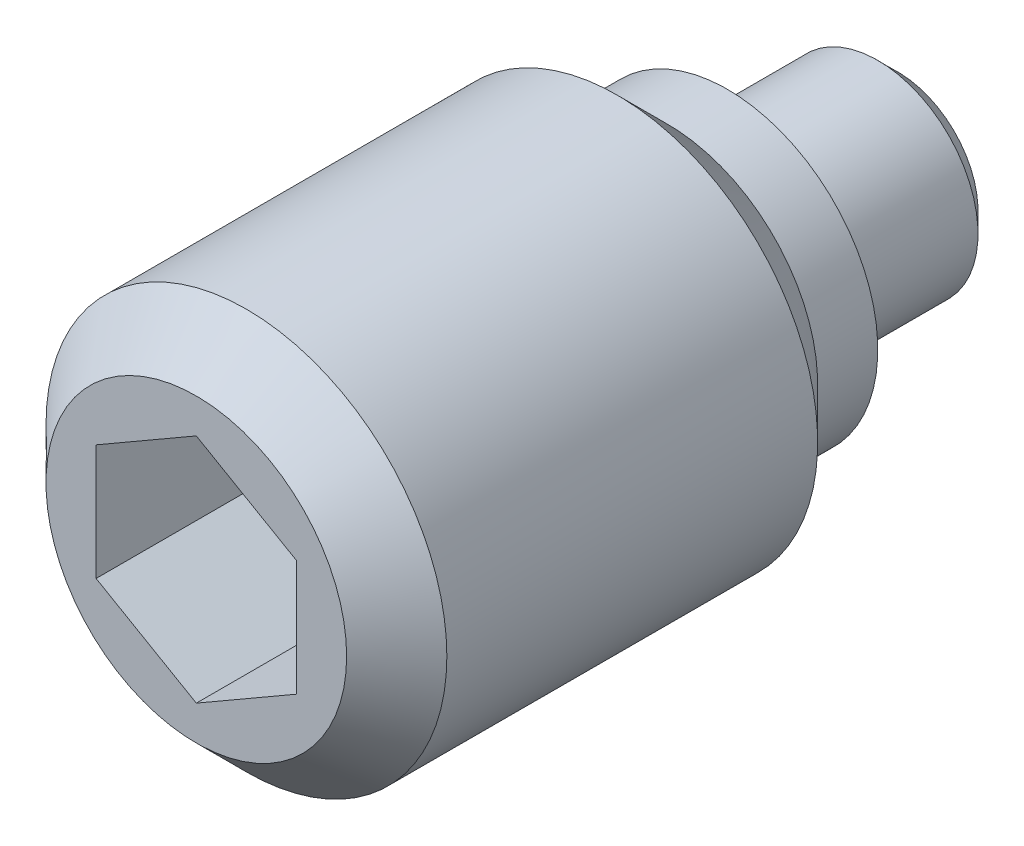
ISO-10303-21;
HEADER;
FILE_DESCRIPTION(('STEP AP214'),'2;1');
FILE_NAME('part.step','',(''),(''),'','','');
FILE_SCHEMA(('AUTOMOTIVE_DESIGN { 1 0 10303 214 1 1 1 1 }'));
ENDSEC;
DATA;
#1=APPLICATION_CONTEXT('core data for automotive mechanical design processes');
#2=APPLICATION_PROTOCOL_DEFINITION('international standard','automotive_design',2000,#1);
#3=PRODUCT_CONTEXT('',#1,'mechanical');
#4=PRODUCT('Part','Part','',(#3));
#5=PRODUCT_RELATED_PRODUCT_CATEGORY('part','',(#4));
#6=PRODUCT_DEFINITION_FORMATION('','',#4);
#7=PRODUCT_DEFINITION_CONTEXT('part definition',#1,'design');
#8=PRODUCT_DEFINITION('design','',#6,#7);
#9=PRODUCT_DEFINITION_SHAPE('','',#8);
#10=(LENGTH_UNIT() NAMED_UNIT(*) SI_UNIT(.MILLI.,.METRE.));
#11=(NAMED_UNIT(*) PLANE_ANGLE_UNIT() SI_UNIT($,.RADIAN.));
#12=(NAMED_UNIT(*) SI_UNIT($,.STERADIAN.) SOLID_ANGLE_UNIT());
#13=UNCERTAINTY_MEASURE_WITH_UNIT(LENGTH_MEASURE(1.E-05),#10,'distance_accuracy_value','');
#14=(GEOMETRIC_REPRESENTATION_CONTEXT(3) GLOBAL_UNCERTAINTY_ASSIGNED_CONTEXT((#13)) GLOBAL_UNIT_ASSIGNED_CONTEXT((#10,
#11,#12)) REPRESENTATION_CONTEXT('',''));
#15=CARTESIAN_POINT('',(0.,0.,0.));
#16=DIRECTION('',(0.,0.,1.));
#17=DIRECTION('',(1.,0.,0.));
#18=AXIS2_PLACEMENT_3D('',#15,#16,#17);
#19=CARTESIAN_POINT('',(0.,0.,0.));
#20=DIRECTION('',(0.,0.,-1.));
#21=DIRECTION('',(-1.,0.,0.));
#22=AXIS2_PLACEMENT_3D('',#19,#20,#21);
#23=CYLINDRICAL_SURFACE('',#22,1.);
#24=CARTESIAN_POINT('',(0.,0.,0.2));
#25=DIRECTION('',(0.,0.,-1.));
#26=DIRECTION('',(-1.,0.,0.));
#27=AXIS2_PLACEMENT_3D('',#24,#25,#26);
#28=CIRCLE('',#27,1.);
#29=CARTESIAN_POINT('',(-1.,0.,0.2));
#30=VERTEX_POINT('',#29);
#31=EDGE_CURVE('E133',#30,#30,#28,.T.);
#32=ORIENTED_EDGE('',*,*,#31,.F.);
#33=EDGE_LOOP('',(#32));
#34=FACE_BOUND('',#33,.T.);
#35=CARTESIAN_POINT('',(0.,0.,1.7));
#36=DIRECTION('',(0.,0.,-1.));
#37=DIRECTION('',(-1.,0.,0.));
#38=AXIS2_PLACEMENT_3D('',#35,#36,#37);
#39=CIRCLE('',#38,1.);
#40=CARTESIAN_POINT('',(-1.,0.,1.7));
#41=VERTEX_POINT('',#40);
#42=EDGE_CURVE('E127',#41,#41,#39,.T.);
#43=ORIENTED_EDGE('',*,*,#42,.T.);
#44=EDGE_LOOP('',(#43));
#45=FACE_BOUND('',#44,.T.);
#46=ADVANCED_FACE('F14',(#34,#45),#23,.T.);
#47=CARTESIAN_POINT('',(0.,0.,0.2));
#48=DIRECTION('',(0.,0.,1.));
#49=DIRECTION('',(1.,0.,0.));
#50=AXIS2_PLACEMENT_3D('',#47,#48,#49);
#51=CONICAL_SURFACE('',#50,1.,0.785398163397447);
#52=CARTESIAN_POINT('',(0.,0.,0.));
#53=DIRECTION('',(0.,0.,-1.));
#54=DIRECTION('',(-1.,0.,0.));
#55=AXIS2_PLACEMENT_3D('',#52,#53,#54);
#56=CIRCLE('',#55,0.8);
#57=CARTESIAN_POINT('',(-0.8,0.,0.));
#58=VERTEX_POINT('',#57);
#59=EDGE_CURVE('E130',#58,#58,#56,.T.);
#60=ORIENTED_EDGE('',*,*,#59,.F.);
#61=EDGE_LOOP('',(#60));
#62=FACE_BOUND('',#61,.T.);
#63=ORIENTED_EDGE('',*,*,#31,.T.);
#64=EDGE_LOOP('',(#63));
#65=FACE_BOUND('',#64,.T.);
#66=ADVANCED_FACE('F157',(#62,#65),#51,.T.);
#67=CARTESIAN_POINT('',(0.,0.8,0.));
#68=DIRECTION('',(0.,0.,1.));
#69=DIRECTION('',(1.,0.,0.));
#70=AXIS2_PLACEMENT_3D('',#67,#68,#69);
#71=PLANE('',#70);
#72=ORIENTED_EDGE('',*,*,#59,.T.);
#73=EDGE_LOOP('',(#72));
#74=FACE_BOUND('',#73,.T.);
#75=ADVANCED_FACE('F154',(#74),#71,.F.);
#76=CARTESIAN_POINT('',(0.,0.,1.7));
#77=DIRECTION('',(0.,0.,-1.));
#78=DIRECTION('',(-1.,0.,0.));
#79=AXIS2_PLACEMENT_3D('',#76,#77,#78);
#80=CYLINDRICAL_SURFACE('',#79,2.);
#81=CARTESIAN_POINT('',(0.,0.,2.8));
#82=DIRECTION('',(0.,0.,-1.));
#83=DIRECTION('',(-1.,0.,0.));
#84=AXIS2_PLACEMENT_3D('',#81,#82,#83);
#85=CIRCLE('',#84,2.);
#86=CARTESIAN_POINT('',(-2.,0.,2.8));
#87=VERTEX_POINT('',#86);
#88=EDGE_CURVE('E9',#87,#87,#85,.T.);
#89=ORIENTED_EDGE('',*,*,#88,.F.);
#90=EDGE_LOOP('',(#89));
#91=FACE_BOUND('',#90,.T.);
#92=CARTESIAN_POINT('',(0.,0.,6.5));
#93=DIRECTION('',(0.,0.,1.));
#94=DIRECTION('',(1.,0.,0.));
#95=AXIS2_PLACEMENT_3D('',#92,#93,#94);
#96=CIRCLE('',#95,2.);
#97=CARTESIAN_POINT('',(2.,0.,6.5));
#98=VERTEX_POINT('',#97);
#99=EDGE_CURVE('E124',#98,#98,#96,.T.);
#100=ORIENTED_EDGE('',*,*,#99,.F.);
#101=EDGE_LOOP('',(#100));
#102=FACE_BOUND('',#101,.T.);
#103=ADVANCED_FACE('F16',(#91,#102),#80,.T.);
#104=CARTESIAN_POINT('',(0.,0.,2.8));
#105=DIRECTION('',(0.,0.,1.));
#106=DIRECTION('',(1.,0.,0.));
#107=AXIS2_PLACEMENT_3D('',#104,#105,#106);
#108=CONICAL_SURFACE('',#107,2.,0.785398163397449);
#109=ORIENTED_EDGE('',*,*,#88,.T.);
#110=EDGE_LOOP('',(#109));
#111=FACE_BOUND('',#110,.T.);
#112=CARTESIAN_POINT('',(0.,0.,2.3));
#113=DIRECTION('',(0.,0.,-1.));
#114=DIRECTION('',(-1.,0.,0.));
#115=AXIS2_PLACEMENT_3D('',#112,#113,#114);
#116=CIRCLE('',#115,1.5);
#117=CARTESIAN_POINT('',(-1.5,0.,2.3));
#118=VERTEX_POINT('',#117);
#119=EDGE_CURVE('E22',#118,#118,#116,.T.);
#120=ORIENTED_EDGE('',*,*,#119,.F.);
#121=EDGE_LOOP('',(#120));
#122=FACE_BOUND('',#121,.T.);
#123=ADVANCED_FACE('F143',(#111,#122),#108,.T.);
#124=CARTESIAN_POINT('',(0.,0.,1.7));
#125=DIRECTION('',(0.,0.,-1.));
#126=DIRECTION('',(-1.,0.,0.));
#127=AXIS2_PLACEMENT_3D('',#124,#125,#126);
#128=CYLINDRICAL_SURFACE('',#127,1.5);
#129=CARTESIAN_POINT('',(0.,0.,1.7));
#130=DIRECTION('',(0.,0.,-1.));
#131=DIRECTION('',(-1.,0.,0.));
#132=AXIS2_PLACEMENT_3D('',#129,#130,#131);
#133=CIRCLE('',#132,1.5);
#134=CARTESIAN_POINT('',(-1.5,0.,1.7));
#135=VERTEX_POINT('',#134);
#136=EDGE_CURVE('E136',#135,#135,#133,.T.);
#137=ORIENTED_EDGE('',*,*,#136,.F.);
#138=EDGE_LOOP('',(#137));
#139=FACE_BOUND('',#138,.T.);
#140=ORIENTED_EDGE('',*,*,#119,.T.);
#141=EDGE_LOOP('',(#140));
#142=FACE_BOUND('',#141,.T.);
#143=ADVANCED_FACE('F141',(#139,#142),#128,.T.);
#144=CARTESIAN_POINT('',(0.,1.5,1.7));
#145=DIRECTION('',(0.,0.,1.));
#146=DIRECTION('',(1.,0.,0.));
#147=AXIS2_PLACEMENT_3D('',#144,#145,#146);
#148=PLANE('',#147);
#149=ORIENTED_EDGE('',*,*,#136,.T.);
#150=EDGE_LOOP('',(#149));
#151=FACE_BOUND('',#150,.T.);
#152=ORIENTED_EDGE('',*,*,#42,.F.);
#153=EDGE_LOOP('',(#152));
#154=FACE_BOUND('',#153,.T.);
#155=ADVANCED_FACE('F151',(#151,#154),#148,.F.);
#156=CARTESIAN_POINT('',(0.,-1.5,7.));
#157=DIRECTION('',(0.,0.,1.));
#158=DIRECTION('',(1.,0.,0.));
#159=AXIS2_PLACEMENT_3D('',#156,#157,#158);
#160=PLANE('',#159);
#161=DIRECTION('',(0.866025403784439,-0.5,0.));
#162=VECTOR('',#161,1.);
#163=CARTESIAN_POINT('',(-1.,-0.577350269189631,7.));
#164=LINE('',#163,#162);
#165=CARTESIAN_POINT('',(-1.,-0.577350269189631,7.));
#166=VERTEX_POINT('',#165);
#167=CARTESIAN_POINT('',(0.,-1.15470053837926,7.));
#168=VERTEX_POINT('',#167);
#169=EDGE_CURVE('E29',#166,#168,#164,.T.);
#170=ORIENTED_EDGE('',*,*,#169,.F.);
#171=DIRECTION('',(0.,-1.,0.));
#172=VECTOR('',#171,1.);
#173=CARTESIAN_POINT('',(-1.,0.577350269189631,7.));
#174=LINE('',#173,#172);
#175=CARTESIAN_POINT('',(-1.,0.577350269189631,7.));
#176=VERTEX_POINT('',#175);
#177=EDGE_CURVE('E112',#176,#166,#174,.T.);
#178=ORIENTED_EDGE('',*,*,#177,.F.);
#179=DIRECTION('',(-0.866025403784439,-0.5,0.));
#180=VECTOR('',#179,1.);
#181=CARTESIAN_POINT('',(0.,1.15470053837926,7.));
#182=LINE('',#181,#180);
#183=CARTESIAN_POINT('',(0.,1.15470053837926,7.));
#184=VERTEX_POINT('',#183);
#185=EDGE_CURVE('E110',#184,#176,#182,.T.);
#186=ORIENTED_EDGE('',*,*,#185,.F.);
#187=DIRECTION('',(-0.866025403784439,0.5,0.));
#188=VECTOR('',#187,1.);
#189=CARTESIAN_POINT('',(1.,0.577350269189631,7.));
#190=LINE('',#189,#188);
#191=CARTESIAN_POINT('',(1.,0.577350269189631,7.));
#192=VERTEX_POINT('',#191);
#193=EDGE_CURVE('E77',#192,#184,#190,.T.);
#194=ORIENTED_EDGE('',*,*,#193,.F.);
#195=DIRECTION('',(0.,1.,0.));
#196=VECTOR('',#195,1.);
#197=CARTESIAN_POINT('',(1.,-0.577350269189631,7.));
#198=LINE('',#197,#196);
#199=CARTESIAN_POINT('',(1.,-0.577350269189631,7.));
#200=VERTEX_POINT('',#199);
#201=EDGE_CURVE('E106',#200,#192,#198,.T.);
#202=ORIENTED_EDGE('',*,*,#201,.F.);
#203=DIRECTION('',(0.866025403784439,0.5,0.));
#204=VECTOR('',#203,1.);
#205=CARTESIAN_POINT('',(0.,-1.15470053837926,7.));
#206=LINE('',#205,#204);
#207=EDGE_CURVE('E103',#168,#200,#206,.T.);
#208=ORIENTED_EDGE('',*,*,#207,.F.);
#209=EDGE_LOOP('',(#170,#178,#186,#194,#202,#208));
#210=FACE_BOUND('',#209,.T.);
#211=CARTESIAN_POINT('',(0.,0.,7.));
#212=DIRECTION('',(0.,0.,1.));
#213=DIRECTION('',(1.,0.,0.));
#214=AXIS2_PLACEMENT_3D('',#211,#212,#213);
#215=CIRCLE('',#214,1.5);
#216=CARTESIAN_POINT('',(1.5,0.,7.));
#217=VERTEX_POINT('',#216);
#218=EDGE_CURVE('E116',#217,#217,#215,.T.);
#219=ORIENTED_EDGE('',*,*,#218,.T.);
#220=EDGE_LOOP('',(#219));
#221=FACE_BOUND('',#220,.T.);
#222=ADVANCED_FACE('F170',(#210,#221),#160,.T.);
#223=CARTESIAN_POINT('',(0.,0.,7.));
#224=DIRECTION('',(0.,0.,-1.));
#225=DIRECTION('',(-1.,0.,0.));
#226=AXIS2_PLACEMENT_3D('',#223,#224,#225);
#227=CONICAL_SURFACE('',#226,1.5,0.785398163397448);
#228=ORIENTED_EDGE('',*,*,#99,.T.);
#229=EDGE_LOOP('',(#228));
#230=FACE_BOUND('',#229,.T.);
#231=ORIENTED_EDGE('',*,*,#218,.F.);
#232=EDGE_LOOP('',(#231));
#233=FACE_BOUND('',#232,.T.);
#234=ADVANCED_FACE('F175',(#230,#233),#227,.T.);
#235=CARTESIAN_POINT('',(-1.,-0.577350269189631,5.));
#236=DIRECTION('',(-0.5,-0.866025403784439,0.));
#237=DIRECTION('',(0.866025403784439,-0.5,0.));
#238=AXIS2_PLACEMENT_3D('',#235,#236,#237);
#239=PLANE('',#238);
#240=ORIENTED_EDGE('',*,*,#169,.T.);
#241=DIRECTION('',(0.,0.,1.));
#242=VECTOR('',#241,1.);
#243=CARTESIAN_POINT('',(0.,-1.15470053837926,5.));
#244=LINE('',#243,#242);
#245=CARTESIAN_POINT('',(0.,-1.15470053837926,5.));
#246=VERTEX_POINT('',#245);
#247=EDGE_CURVE('E59',#246,#168,#244,.T.);
#248=ORIENTED_EDGE('',*,*,#247,.F.);
#249=DIRECTION('',(0.866025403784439,-0.5,0.));
#250=VECTOR('',#249,1.);
#251=CARTESIAN_POINT('',(-1.,-0.577350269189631,5.));
#252=LINE('',#251,#250);
#253=CARTESIAN_POINT('',(-1.,-0.577350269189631,5.));
#254=VERTEX_POINT('',#253);
#255=EDGE_CURVE('E114',#254,#246,#252,.T.);
#256=ORIENTED_EDGE('',*,*,#255,.F.);
#257=DIRECTION('',(0.,0.,1.));
#258=VECTOR('',#257,1.);
#259=CARTESIAN_POINT('',(-1.,-0.577350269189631,5.));
#260=LINE('',#259,#258);
#261=EDGE_CURVE('E37',#254,#166,#260,.T.);
#262=ORIENTED_EDGE('',*,*,#261,.T.);
#263=EDGE_LOOP('',(#240,#248,#256,#262));
#264=FACE_BOUND('',#263,.T.);
#265=ADVANCED_FACE('F184',(#264),#239,.F.);
#266=CARTESIAN_POINT('',(-1.,0.577350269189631,5.));
#267=DIRECTION('',(-1.,0.,0.));
#268=DIRECTION('',(0.,0.,1.));
#269=AXIS2_PLACEMENT_3D('',#266,#267,#268);
#270=PLANE('',#269);
#271=ORIENTED_EDGE('',*,*,#177,.T.);
#272=ORIENTED_EDGE('',*,*,#261,.F.);
#273=DIRECTION('',(0.,-1.,0.));
#274=VECTOR('',#273,1.);
#275=CARTESIAN_POINT('',(-1.,0.577350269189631,5.));
#276=LINE('',#275,#274);
#277=CARTESIAN_POINT('',(-1.,0.577350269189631,5.));
#278=VERTEX_POINT('',#277);
#279=EDGE_CURVE('E89',#278,#254,#276,.T.);
#280=ORIENTED_EDGE('',*,*,#279,.F.);
#281=DIRECTION('',(0.,0.,1.));
#282=VECTOR('',#281,1.);
#283=CARTESIAN_POINT('',(-1.,0.577350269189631,5.));
#284=LINE('',#283,#282);
#285=EDGE_CURVE('E81',#278,#176,#284,.T.);
#286=ORIENTED_EDGE('',*,*,#285,.T.);
#287=EDGE_LOOP('',(#271,#272,#280,#286));
#288=FACE_BOUND('',#287,.T.);
#289=ADVANCED_FACE('F244',(#288),#270,.F.);
#290=CARTESIAN_POINT('',(0.,1.15470053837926,5.));
#291=DIRECTION('',(-0.5,0.866025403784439,0.));
#292=DIRECTION('',(-0.866025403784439,-0.5,0.));
#293=AXIS2_PLACEMENT_3D('',#290,#291,#292);
#294=PLANE('',#293);
#295=ORIENTED_EDGE('',*,*,#185,.T.);
#296=ORIENTED_EDGE('',*,*,#285,.F.);
#297=DIRECTION('',(-0.866025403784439,-0.5,0.));
#298=VECTOR('',#297,1.);
#299=CARTESIAN_POINT('',(0.,1.15470053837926,5.));
#300=LINE('',#299,#298);
#301=CARTESIAN_POINT('',(0.,1.15470053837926,5.));
#302=VERTEX_POINT('',#301);
#303=EDGE_CURVE('E85',#302,#278,#300,.T.);
#304=ORIENTED_EDGE('',*,*,#303,.F.);
#305=DIRECTION('',(0.,0.,1.));
#306=VECTOR('',#305,1.);
#307=CARTESIAN_POINT('',(0.,1.15470053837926,5.));
#308=LINE('',#307,#306);
#309=EDGE_CURVE('E70',#302,#184,#308,.T.);
#310=ORIENTED_EDGE('',*,*,#309,.T.);
#311=EDGE_LOOP('',(#295,#296,#304,#310));
#312=FACE_BOUND('',#311,.T.);
#313=ADVANCED_FACE('F86',(#312),#294,.F.);
#314=CARTESIAN_POINT('',(1.,0.577350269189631,5.));
#315=DIRECTION('',(0.5,0.866025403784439,0.));
#316=DIRECTION('',(-0.866025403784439,0.5,0.));
#317=AXIS2_PLACEMENT_3D('',#314,#315,#316);
#318=PLANE('',#317);
#319=ORIENTED_EDGE('',*,*,#193,.T.);
#320=ORIENTED_EDGE('',*,*,#309,.F.);
#321=DIRECTION('',(-0.866025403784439,0.5,0.));
#322=VECTOR('',#321,1.);
#323=CARTESIAN_POINT('',(1.,0.577350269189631,5.));
#324=LINE('',#323,#322);
#325=CARTESIAN_POINT('',(1.,0.577350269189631,5.));
#326=VERTEX_POINT('',#325);
#327=EDGE_CURVE('E74',#326,#302,#324,.T.);
#328=ORIENTED_EDGE('',*,*,#327,.F.);
#329=DIRECTION('',(0.,0.,1.));
#330=VECTOR('',#329,1.);
#331=CARTESIAN_POINT('',(1.,0.577350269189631,5.));
#332=LINE('',#331,#330);
#333=EDGE_CURVE('E82',#326,#192,#332,.T.);
#334=ORIENTED_EDGE('',*,*,#333,.T.);
#335=EDGE_LOOP('',(#319,#320,#328,#334));
#336=FACE_BOUND('',#335,.T.);
#337=ADVANCED_FACE('F72',(#336),#318,.F.);
#338=CARTESIAN_POINT('',(1.,-0.577350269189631,5.));
#339=DIRECTION('',(1.,0.,0.));
#340=DIRECTION('',(0.,0.,-1.));
#341=AXIS2_PLACEMENT_3D('',#338,#339,#340);
#342=PLANE('',#341);
#343=ORIENTED_EDGE('',*,*,#201,.T.);
#344=ORIENTED_EDGE('',*,*,#333,.F.);
#345=DIRECTION('',(0.,1.,0.));
#346=VECTOR('',#345,1.);
#347=CARTESIAN_POINT('',(1.,-0.577350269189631,5.));
#348=LINE('',#347,#346);
#349=CARTESIAN_POINT('',(1.,-0.577350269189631,5.));
#350=VERTEX_POINT('',#349);
#351=EDGE_CURVE('E95',#350,#326,#348,.T.);
#352=ORIENTED_EDGE('',*,*,#351,.F.);
#353=DIRECTION('',(0.,0.,1.));
#354=VECTOR('',#353,1.);
#355=CARTESIAN_POINT('',(1.,-0.577350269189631,5.));
#356=LINE('',#355,#354);
#357=EDGE_CURVE('E119',#350,#200,#356,.T.);
#358=ORIENTED_EDGE('',*,*,#357,.T.);
#359=EDGE_LOOP('',(#343,#344,#352,#358));
#360=FACE_BOUND('',#359,.T.);
#361=ADVANCED_FACE('F268',(#360),#342,.F.);
#362=CARTESIAN_POINT('',(0.,-1.15470053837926,5.));
#363=DIRECTION('',(0.5,-0.866025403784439,0.));
#364=DIRECTION('',(0.866025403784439,0.5,0.));
#365=AXIS2_PLACEMENT_3D('',#362,#363,#364);
#366=PLANE('',#365);
#367=ORIENTED_EDGE('',*,*,#207,.T.);
#368=ORIENTED_EDGE('',*,*,#357,.F.);
#369=DIRECTION('',(0.866025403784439,0.5,0.));
#370=VECTOR('',#369,1.);
#371=CARTESIAN_POINT('',(0.,-1.15470053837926,5.));
#372=LINE('',#371,#370);
#373=EDGE_CURVE('E97',#246,#350,#372,.T.);
#374=ORIENTED_EDGE('',*,*,#373,.F.);
#375=ORIENTED_EDGE('',*,*,#247,.T.);
#376=EDGE_LOOP('',(#367,#368,#374,#375));
#377=FACE_BOUND('',#376,.T.);
#378=ADVANCED_FACE('F277',(#377),#366,.F.);
#379=CARTESIAN_POINT('',(0.,0.,5.));
#380=DIRECTION('',(0.,0.,1.));
#381=DIRECTION('',(1.,0.,0.));
#382=AXIS2_PLACEMENT_3D('',#379,#380,#381);
#383=PLANE('',#382);
#384=ORIENTED_EDGE('',*,*,#255,.T.);
#385=ORIENTED_EDGE('',*,*,#373,.T.);
#386=ORIENTED_EDGE('',*,*,#351,.T.);
#387=ORIENTED_EDGE('',*,*,#327,.T.);
#388=ORIENTED_EDGE('',*,*,#303,.T.);
#389=ORIENTED_EDGE('',*,*,#279,.T.);
#390=EDGE_LOOP('',(#384,#385,#386,#387,#388,#389));
#391=FACE_BOUND('',#390,.T.);
#392=ADVANCED_FACE('F92',(#391),#383,.T.);
#393=CLOSED_SHELL('',(#46,#66,#75,#103,#123,#143,#155,#222,#234,#265,#289,#313,#337,#361,#378,#392));
#394=MANIFOLD_SOLID_BREP('B1',#393);
#395=ADVANCED_BREP_SHAPE_REPRESENTATION('',(#18,#394),#14);
#396=SHAPE_DEFINITION_REPRESENTATION(#9,#395);
ENDSEC;
END-ISO-10303-21;
